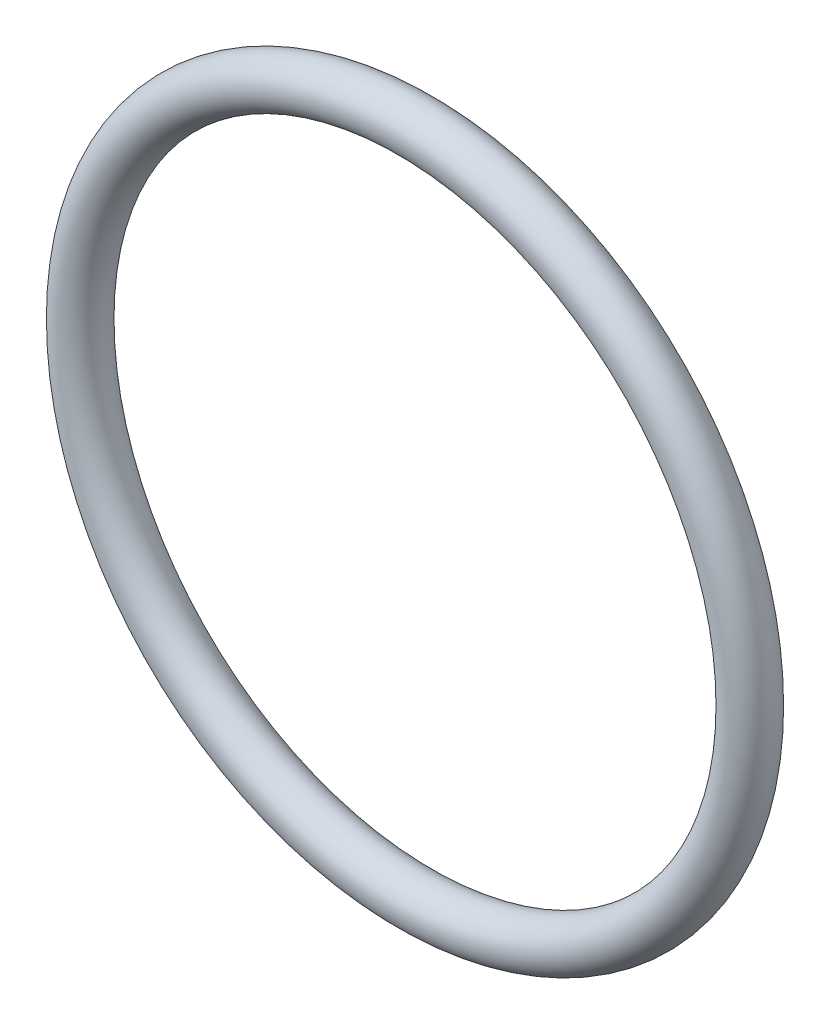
ISO-10303-21;
HEADER;
FILE_DESCRIPTION(('STEP AP214'),'2;1');
FILE_NAME('part.step','',(''),(''),'','','');
FILE_SCHEMA(('AUTOMOTIVE_DESIGN { 1 0 10303 214 1 1 1 1 }'));
ENDSEC;
DATA;
#1=APPLICATION_CONTEXT('core data for automotive mechanical design processes');
#2=APPLICATION_PROTOCOL_DEFINITION('international standard','automotive_design',2000,#1);
#3=PRODUCT_CONTEXT('',#1,'mechanical');
#4=PRODUCT('Part','Part','',(#3));
#5=PRODUCT_RELATED_PRODUCT_CATEGORY('part','',(#4));
#6=PRODUCT_DEFINITION_FORMATION('','',#4);
#7=PRODUCT_DEFINITION_CONTEXT('part definition',#1,'design');
#8=PRODUCT_DEFINITION('design','',#6,#7);
#9=PRODUCT_DEFINITION_SHAPE('','',#8);
#10=(LENGTH_UNIT() NAMED_UNIT(*) SI_UNIT(.MILLI.,.METRE.));
#11=(NAMED_UNIT(*) PLANE_ANGLE_UNIT() SI_UNIT($,.RADIAN.));
#12=(NAMED_UNIT(*) SI_UNIT($,.STERADIAN.) SOLID_ANGLE_UNIT());
#13=UNCERTAINTY_MEASURE_WITH_UNIT(LENGTH_MEASURE(1.E-05),#10,'distance_accuracy_value','');
#14=(GEOMETRIC_REPRESENTATION_CONTEXT(3) GLOBAL_UNCERTAINTY_ASSIGNED_CONTEXT((#13)) GLOBAL_UNIT_ASSIGNED_CONTEXT((#10,
#11,#12)) REPRESENTATION_CONTEXT('',''));
#15=CARTESIAN_POINT('',(0.,0.,0.));
#16=DIRECTION('',(0.,0.,1.));
#17=DIRECTION('',(1.,0.,0.));
#18=AXIS2_PLACEMENT_3D('',#15,#16,#17);
#19=CARTESIAN_POINT('',(0.,0.,0.));
#20=DIRECTION('',(0.,0.,1.));
#21=DIRECTION('',(1.,0.,0.));
#22=AXIS2_PLACEMENT_3D('',#19,#20,#21);
#23=TOROIDAL_SURFACE('',#22,14.,1.);
#24=CARTESIAN_POINT('',(15.,0.,0.));
#25=VERTEX_POINT('',#24);
#26=VERTEX_LOOP('',#25);
#27=FACE_BOUND('',#26,.T.);
#28=ADVANCED_FACE('F33',(#27),#23,.T.);
#29=CLOSED_SHELL('',(#28));
#30=MANIFOLD_SOLID_BREP('B2',#29);
#31=ADVANCED_BREP_SHAPE_REPRESENTATION('',(#18,#30),#14);
#32=SHAPE_DEFINITION_REPRESENTATION(#9,#31);
ENDSEC;
END-ISO-10303-21;
